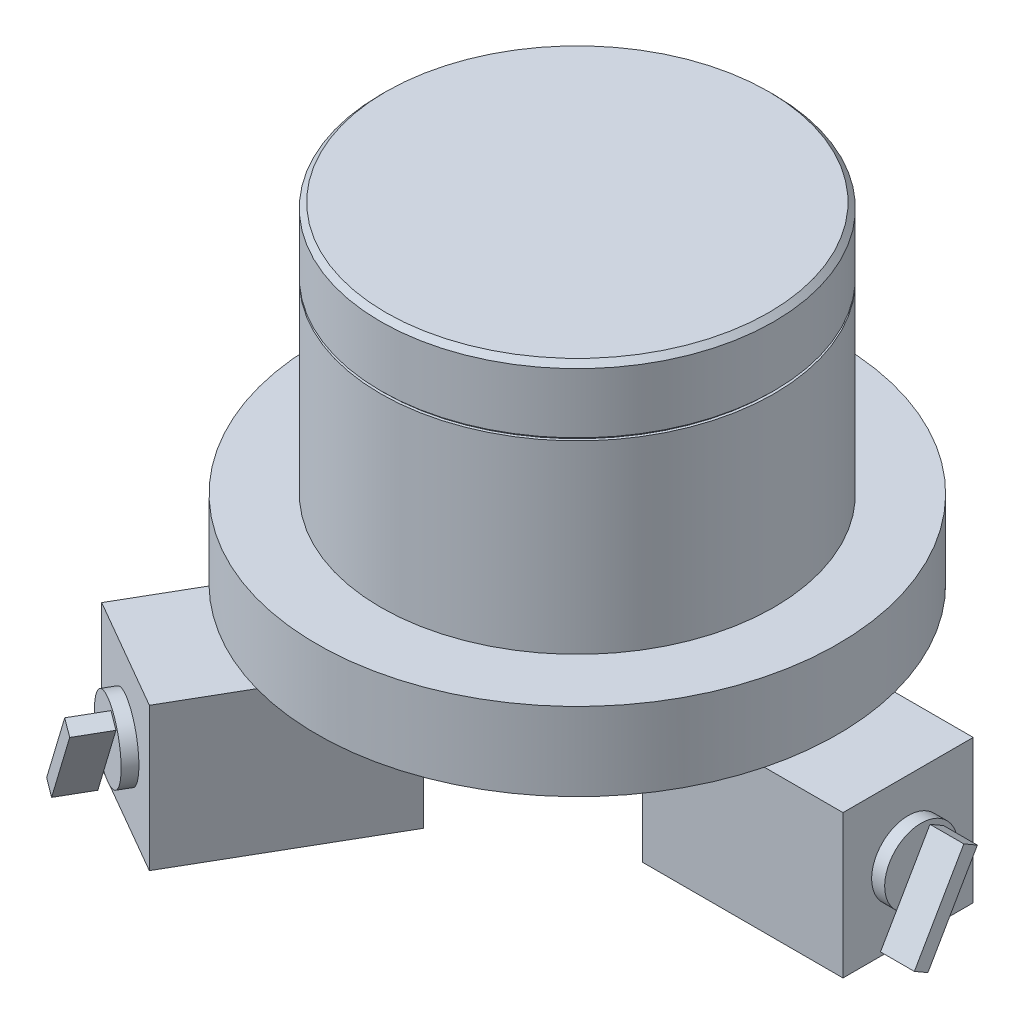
ISO-10303-21;
HEADER;
FILE_DESCRIPTION(('STEP AP214'),'2;1');
FILE_NAME('part.step','',(''),(''),'','','');
FILE_SCHEMA(('AUTOMOTIVE_DESIGN { 1 0 10303 214 1 1 1 1 }'));
ENDSEC;
DATA;
#1=APPLICATION_CONTEXT('core data for automotive mechanical design processes');
#2=APPLICATION_PROTOCOL_DEFINITION('international standard','automotive_design',2000,#1);
#3=PRODUCT_CONTEXT('',#1,'mechanical');
#4=PRODUCT('Part','Part','',(#3));
#5=PRODUCT_RELATED_PRODUCT_CATEGORY('part','',(#4));
#6=PRODUCT_DEFINITION_FORMATION('','',#4);
#7=PRODUCT_DEFINITION_CONTEXT('part definition',#1,'design');
#8=PRODUCT_DEFINITION('design','',#6,#7);
#9=PRODUCT_DEFINITION_SHAPE('','',#8);
#10=(LENGTH_UNIT() NAMED_UNIT(*) SI_UNIT(.MILLI.,.METRE.));
#11=(NAMED_UNIT(*) PLANE_ANGLE_UNIT() SI_UNIT($,.RADIAN.));
#12=(NAMED_UNIT(*) SI_UNIT($,.STERADIAN.) SOLID_ANGLE_UNIT());
#13=UNCERTAINTY_MEASURE_WITH_UNIT(LENGTH_MEASURE(1.E-05),#10,'distance_accuracy_value','');
#14=(GEOMETRIC_REPRESENTATION_CONTEXT(3) GLOBAL_UNCERTAINTY_ASSIGNED_CONTEXT((#13)) GLOBAL_UNIT_ASSIGNED_CONTEXT((#10,
#11,#12)) REPRESENTATION_CONTEXT('',''));
#15=CARTESIAN_POINT('',(0.,0.,0.));
#16=DIRECTION('',(0.,0.,1.));
#17=DIRECTION('',(1.,0.,0.));
#18=AXIS2_PLACEMENT_3D('',#15,#16,#17);
#19=CARTESIAN_POINT('',(-85.1506350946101,0.,97.4852262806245));
#20=DIRECTION('',(-0.499999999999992,0.,0.866025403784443));
#21=DIRECTION('',(0.866025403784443,0.,0.499999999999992));
#22=AXIS2_PLACEMENT_3D('',#19,#20,#21);
#23=PLANE('',#22);
#24=DIRECTION('',(0.866025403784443,0.,0.499999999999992));
#25=VECTOR('',#24,1.);
#26=CARTESIAN_POINT('',(-85.1506350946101,55.,97.4852262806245));
#27=LINE('',#26,#25);
#28=CARTESIAN_POINT('',(-85.1506350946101,55.,97.4852262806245));
#29=VERTEX_POINT('',#28);
#30=CARTESIAN_POINT('',(-41.8493649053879,55.,122.485226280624));
#31=VERTEX_POINT('',#30);
#32=EDGE_CURVE('E302',#29,#31,#27,.T.);
#33=ORIENTED_EDGE('',*,*,#32,.F.);
#34=DIRECTION('',(0.,1.,0.));
#35=VECTOR('',#34,1.);
#36=CARTESIAN_POINT('',(-85.1506350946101,0.,97.4852262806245));
#37=LINE('',#36,#35);
#38=CARTESIAN_POINT('',(-85.1506350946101,0.,97.4852262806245));
#39=VERTEX_POINT('',#38);
#40=EDGE_CURVE('E328',#39,#29,#37,.T.);
#41=ORIENTED_EDGE('',*,*,#40,.F.);
#42=DIRECTION('',(0.866025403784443,0.,0.499999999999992));
#43=VECTOR('',#42,1.);
#44=CARTESIAN_POINT('',(-85.1506350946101,0.,97.4852262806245));
#45=LINE('',#44,#43);
#46=CARTESIAN_POINT('',(-41.8493649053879,0.,122.485226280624));
#47=VERTEX_POINT('',#46);
#48=EDGE_CURVE('E315',#39,#47,#45,.T.);
#49=ORIENTED_EDGE('',*,*,#48,.T.);
#50=DIRECTION('',(0.,1.,0.));
#51=VECTOR('',#50,1.);
#52=CARTESIAN_POINT('',(-41.8493649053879,0.,122.485226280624));
#53=LINE('',#52,#51);
#54=EDGE_CURVE('E327',#47,#31,#53,.T.);
#55=ORIENTED_EDGE('',*,*,#54,.T.);
#56=EDGE_LOOP('',(#33,#41,#49,#55));
#57=FACE_BOUND('',#56,.T.);
#58=CARTESIAN_POINT('',(-63.499999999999,27.5,109.985226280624));
#59=DIRECTION('',(-0.499999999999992,0.,0.866025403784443));
#60=DIRECTION('',(0.866025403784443,0.,0.499999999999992));
#61=AXIS2_PLACEMENT_3D('',#58,#59,#60);
#62=CIRCLE('',#61,14.);
#63=CARTESIAN_POINT('',(-51.3756443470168,27.5,116.985226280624));
#64=VERTEX_POINT('',#63);
#65=EDGE_CURVE('E289',#64,#64,#62,.T.);
#66=ORIENTED_EDGE('',*,*,#65,.F.);
#67=EDGE_LOOP('',(#66));
#68=FACE_BOUND('',#67,.T.);
#69=ADVANCED_FACE('F32',(#57,#68),#23,.T.);
#70=CARTESIAN_POINT('',(-41.8493649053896,0.,-122.485226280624));
#71=DIRECTION('',(-0.500000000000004,0.,-0.866025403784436));
#72=DIRECTION('',(-0.866025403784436,0.,0.500000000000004));
#73=AXIS2_PLACEMENT_3D('',#70,#71,#72);
#74=PLANE('',#73);
#75=DIRECTION('',(-0.866025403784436,0.,0.500000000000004));
#76=VECTOR('',#75,1.);
#77=CARTESIAN_POINT('',(-41.8493649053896,55.,-122.485226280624));
#78=LINE('',#77,#76);
#79=CARTESIAN_POINT('',(-41.8493649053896,55.,-122.485226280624));
#80=VERTEX_POINT('',#79);
#81=CARTESIAN_POINT('',(-85.1506350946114,55.,-97.4852262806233));
#82=VERTEX_POINT('',#81);
#83=EDGE_CURVE('E331',#80,#82,#78,.T.);
#84=ORIENTED_EDGE('',*,*,#83,.F.);
#85=DIRECTION('',(0.,1.,0.));
#86=VECTOR('',#85,1.);
#87=CARTESIAN_POINT('',(-41.8493649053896,0.,-122.485226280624));
#88=LINE('',#87,#86);
#89=CARTESIAN_POINT('',(-41.8493649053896,0.,-122.485226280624));
#90=VERTEX_POINT('',#89);
#91=EDGE_CURVE('E364',#90,#80,#88,.T.);
#92=ORIENTED_EDGE('',*,*,#91,.F.);
#93=DIRECTION('',(-0.866025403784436,0.,0.500000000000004));
#94=VECTOR('',#93,1.);
#95=CARTESIAN_POINT('',(-41.8493649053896,0.,-122.485226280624));
#96=LINE('',#95,#94);
#97=CARTESIAN_POINT('',(-85.1506350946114,0.,-97.4852262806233));
#98=VERTEX_POINT('',#97);
#99=EDGE_CURVE('E351',#90,#98,#96,.T.);
#100=ORIENTED_EDGE('',*,*,#99,.T.);
#101=DIRECTION('',(0.,1.,0.));
#102=VECTOR('',#101,1.);
#103=CARTESIAN_POINT('',(-85.1506350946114,0.,-97.4852262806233));
#104=LINE('',#103,#102);
#105=EDGE_CURVE('E363',#98,#82,#104,.T.);
#106=ORIENTED_EDGE('',*,*,#105,.T.);
#107=EDGE_LOOP('',(#84,#92,#100,#106));
#108=FACE_BOUND('',#107,.T.);
#109=CARTESIAN_POINT('',(-63.5000000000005,27.5,-109.985226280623));
#110=DIRECTION('',(-0.500000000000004,0.,-0.866025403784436));
#111=DIRECTION('',(-0.866025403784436,0.,0.500000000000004));
#112=AXIS2_PLACEMENT_3D('',#109,#110,#111);
#113=CIRCLE('',#112,14.);
#114=CARTESIAN_POINT('',(-75.6243556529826,27.5,-102.985226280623));
#115=VERTEX_POINT('',#114);
#116=EDGE_CURVE('E295',#115,#115,#113,.T.);
#117=ORIENTED_EDGE('',*,*,#116,.F.);
#118=EDGE_LOOP('',(#117));
#119=FACE_BOUND('',#118,.T.);
#120=ADVANCED_FACE('F533',(#108,#119),#74,.T.);
#121=CARTESIAN_POINT('',(127.,0.,25.));
#122=DIRECTION('',(1.,0.,0.));
#123=DIRECTION('',(0.,0.,-1.));
#124=AXIS2_PLACEMENT_3D('',#121,#122,#123);
#125=PLANE('',#124);
#126=DIRECTION('',(0.,0.,-1.));
#127=VECTOR('',#126,1.);
#128=CARTESIAN_POINT('',(127.,55.,25.));
#129=LINE('',#128,#127);
#130=CARTESIAN_POINT('',(127.,55.,25.));
#131=VERTEX_POINT('',#130);
#132=CARTESIAN_POINT('',(127.,55.,-25.));
#133=VERTEX_POINT('',#132);
#134=EDGE_CURVE('E415',#131,#133,#129,.T.);
#135=ORIENTED_EDGE('',*,*,#134,.F.);
#136=DIRECTION('',(0.,1.,0.));
#137=VECTOR('',#136,1.);
#138=CARTESIAN_POINT('',(127.,0.,25.));
#139=LINE('',#138,#137);
#140=CARTESIAN_POINT('',(127.,0.,25.));
#141=VERTEX_POINT('',#140);
#142=EDGE_CURVE('E442',#141,#131,#139,.T.);
#143=ORIENTED_EDGE('',*,*,#142,.F.);
#144=DIRECTION('',(0.,0.,-1.));
#145=VECTOR('',#144,1.);
#146=CARTESIAN_POINT('',(127.,0.,25.));
#147=LINE('',#146,#145);
#148=CARTESIAN_POINT('',(127.,0.,-25.));
#149=VERTEX_POINT('',#148);
#150=EDGE_CURVE('E429',#141,#149,#147,.T.);
#151=ORIENTED_EDGE('',*,*,#150,.T.);
#152=DIRECTION('',(0.,1.,0.));
#153=VECTOR('',#152,1.);
#154=CARTESIAN_POINT('',(127.,0.,-25.));
#155=LINE('',#154,#153);
#156=EDGE_CURVE('E441',#149,#133,#155,.T.);
#157=ORIENTED_EDGE('',*,*,#156,.T.);
#158=EDGE_LOOP('',(#135,#143,#151,#157));
#159=FACE_BOUND('',#158,.T.);
#160=CARTESIAN_POINT('',(127.,27.5,0.));
#161=DIRECTION('',(1.,0.,0.));
#162=DIRECTION('',(0.,0.,-1.));
#163=AXIS2_PLACEMENT_3D('',#160,#161,#162);
#164=CIRCLE('',#163,14.);
#165=CARTESIAN_POINT('',(127.,27.5,-14.));
#166=VERTEX_POINT('',#165);
#167=EDGE_CURVE('E408',#166,#166,#164,.T.);
#168=ORIENTED_EDGE('',*,*,#167,.F.);
#169=EDGE_LOOP('',(#168));
#170=FACE_BOUND('',#169,.T.);
#171=ADVANCED_FACE('F539',(#159,#170),#125,.T.);
#172=CARTESIAN_POINT('',(0.,55.,0.));
#173=DIRECTION('',(0.,-1.,0.));
#174=DIRECTION('',(0.,0.,-1.));
#175=AXIS2_PLACEMENT_3D('',#172,#173,#174);
#176=PLANE('',#175);
#177=DIRECTION('',(-0.499999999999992,0.,0.866025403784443));
#178=VECTOR('',#177,1.);
#179=CARTESIAN_POINT('',(-85.1506350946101,55.,97.4852262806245));
#180=LINE('',#179,#178);
#181=CARTESIAN_POINT('',(-46.6506350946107,55.,30.8012701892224));
#182=VERTEX_POINT('',#181);
#183=CARTESIAN_POINT('',(-70.062926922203,55.,71.3525491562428));
#184=VERTEX_POINT('',#183);
#185=EDGE_CURVE('E312',#182,#184,#180,.T.);
#186=ORIENTED_EDGE('',*,*,#185,.T.);
#187=CARTESIAN_POINT('',(0.,55.,0.));
#188=DIRECTION('',(0.,-1.,0.));
#189=DIRECTION('',(0.,0.,-1.));
#190=AXIS2_PLACEMENT_3D('',#187,#188,#189);
#191=CIRCLE('',#190,100.);
#192=CARTESIAN_POINT('',(-70.062926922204,55.,-71.3525491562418));
#193=VERTEX_POINT('',#192);
#194=EDGE_CURVE('E481',#184,#193,#191,.T.);
#195=ORIENTED_EDGE('',*,*,#194,.T.);
#196=DIRECTION('',(0.500000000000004,0.,0.866025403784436));
#197=VECTOR('',#196,1.);
#198=CARTESIAN_POINT('',(-85.1506350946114,55.,-97.4852262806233));
#199=LINE('',#198,#197);
#200=CARTESIAN_POINT('',(-46.6506350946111,55.,-30.8012701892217));
#201=VERTEX_POINT('',#200);
#202=EDGE_CURVE('E341',#193,#201,#199,.T.);
#203=ORIENTED_EDGE('',*,*,#202,.T.);
#204=DIRECTION('',(0.866025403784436,0.,-0.500000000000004));
#205=VECTOR('',#204,1.);
#206=CARTESIAN_POINT('',(-3.34936490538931,55.,-55.8012701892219));
#207=LINE('',#206,#205);
#208=CARTESIAN_POINT('',(-3.34936490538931,55.,-55.8012701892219));
#209=VERTEX_POINT('',#208);
#210=EDGE_CURVE('E345',#201,#209,#207,.T.);
#211=ORIENTED_EDGE('',*,*,#210,.T.);
#212=DIRECTION('',(-0.500000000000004,0.,-0.866025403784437));
#213=VECTOR('',#212,1.);
#214=CARTESIAN_POINT('',(-41.8493649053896,55.,-122.485226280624));
#215=LINE('',#214,#213);
#216=CARTESIAN_POINT('',(-26.7616567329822,55.,-96.352549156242));
#217=VERTEX_POINT('',#216);
#218=EDGE_CURVE('E348',#209,#217,#215,.T.);
#219=ORIENTED_EDGE('',*,*,#218,.T.);
#220=CARTESIAN_POINT('',(96.8245836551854,55.,-25.));
#221=VERTEX_POINT('',#220);
#222=EDGE_CURVE('E472',#217,#221,#191,.T.);
#223=ORIENTED_EDGE('',*,*,#222,.T.);
#224=DIRECTION('',(-1.,0.,0.));
#225=VECTOR('',#224,1.);
#226=CARTESIAN_POINT('',(127.,55.,-25.));
#227=LINE('',#226,#225);
#228=CARTESIAN_POINT('',(50.,55.,-25.));
#229=VERTEX_POINT('',#228);
#230=EDGE_CURVE('E422',#221,#229,#227,.T.);
#231=ORIENTED_EDGE('',*,*,#230,.T.);
#232=DIRECTION('',(0.,0.,1.));
#233=VECTOR('',#232,1.);
#234=CARTESIAN_POINT('',(50.,55.,25.));
#235=LINE('',#234,#233);
#236=CARTESIAN_POINT('',(50.,55.,25.));
#237=VERTEX_POINT('',#236);
#238=EDGE_CURVE('E421',#229,#237,#235,.T.);
#239=ORIENTED_EDGE('',*,*,#238,.T.);
#240=DIRECTION('',(1.,0.,0.));
#241=VECTOR('',#240,1.);
#242=CARTESIAN_POINT('',(127.,55.,25.));
#243=LINE('',#242,#241);
#244=CARTESIAN_POINT('',(96.8245836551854,55.,25.));
#245=VERTEX_POINT('',#244);
#246=EDGE_CURVE('E426',#237,#245,#243,.T.);
#247=ORIENTED_EDGE('',*,*,#246,.T.);
#248=CARTESIAN_POINT('',(-26.7616567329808,55.,96.3525491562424));
#249=VERTEX_POINT('',#248);
#250=EDGE_CURVE('E482',#245,#249,#191,.T.);
#251=ORIENTED_EDGE('',*,*,#250,.T.);
#252=DIRECTION('',(0.499999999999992,0.,-0.866025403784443));
#253=VECTOR('',#252,1.);
#254=CARTESIAN_POINT('',(-41.8493649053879,55.,122.485226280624));
#255=LINE('',#254,#253);
#256=CARTESIAN_POINT('',(-3.34936490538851,55.,55.801270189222));
#257=VERTEX_POINT('',#256);
#258=EDGE_CURVE('E305',#249,#257,#255,.T.);
#259=ORIENTED_EDGE('',*,*,#258,.T.);
#260=DIRECTION('',(-0.866025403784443,0.,-0.499999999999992));
#261=VECTOR('',#260,1.);
#262=CARTESIAN_POINT('',(-46.6506350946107,55.,30.8012701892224));
#263=LINE('',#262,#261);
#264=EDGE_CURVE('E309',#257,#182,#263,.T.);
#265=ORIENTED_EDGE('',*,*,#264,.T.);
#266=EDGE_LOOP('',(#186,#195,#203,#211,#219,#223,#231,#239,#247,#251,#259,#265));
#267=FACE_BOUND('',#266,.T.);
#268=ADVANCED_FACE('F34',(#267),#176,.T.);
#269=CARTESIAN_POINT('',(0.,-14.7594594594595,0.));
#270=DIRECTION('',(0.,-1.,0.));
#271=DIRECTION('',(0.,0.,-1.));
#272=AXIS2_PLACEMENT_3D('',#269,#270,#271);
#273=CYLINDRICAL_SURFACE('',#272,100.);
#274=CARTESIAN_POINT('',(0.,85.,0.));
#275=DIRECTION('',(0.,-1.,0.));
#276=DIRECTION('',(0.,0.,-1.));
#277=AXIS2_PLACEMENT_3D('',#274,#275,#276);
#278=CIRCLE('',#277,100.);
#279=CARTESIAN_POINT('',(0.,85.,-100.));
#280=VERTEX_POINT('',#279);
#281=EDGE_CURVE('E470',#280,#280,#278,.T.);
#282=ORIENTED_EDGE('',*,*,#281,.T.);
#283=EDGE_LOOP('',(#282));
#284=FACE_BOUND('',#283,.T.);
#285=EDGE_CURVE('E36',#221,#245,#191,.T.);
#286=ORIENTED_EDGE('',*,*,#285,.F.);
#287=ORIENTED_EDGE('',*,*,#222,.F.);
#288=EDGE_CURVE('E475',#193,#217,#191,.T.);
#289=ORIENTED_EDGE('',*,*,#288,.F.);
#290=ORIENTED_EDGE('',*,*,#194,.F.);
#291=EDGE_CURVE('E476',#249,#184,#191,.T.);
#292=ORIENTED_EDGE('',*,*,#291,.F.);
#293=ORIENTED_EDGE('',*,*,#250,.F.);
#294=EDGE_LOOP('',(#286,#287,#289,#290,#292,#293));
#295=FACE_BOUND('',#294,.T.);
#296=ADVANCED_FACE('F652',(#284,#295),#273,.T.);
#297=CARTESIAN_POINT('',(100.,85.,0.));
#298=DIRECTION('',(0.,1.,0.));
#299=DIRECTION('',(0.,0.,1.));
#300=AXIS2_PLACEMENT_3D('',#297,#298,#299);
#301=PLANE('',#300);
#302=CARTESIAN_POINT('',(0.,85.,0.));
#303=DIRECTION('',(0.,-1.,0.));
#304=DIRECTION('',(0.,0.,-1.));
#305=AXIS2_PLACEMENT_3D('',#302,#303,#304);
#306=CIRCLE('',#305,75.5);
#307=CARTESIAN_POINT('',(0.,85.,-75.5));
#308=VERTEX_POINT('',#307);
#309=EDGE_CURVE('E468',#308,#308,#306,.T.);
#310=ORIENTED_EDGE('',*,*,#309,.T.);
#311=EDGE_LOOP('',(#310));
#312=FACE_BOUND('',#311,.T.);
#313=ORIENTED_EDGE('',*,*,#281,.F.);
#314=EDGE_LOOP('',(#313));
#315=FACE_BOUND('',#314,.T.);
#316=ADVANCED_FACE('F649',(#312,#315),#301,.T.);
#317=CARTESIAN_POINT('',(0.,-14.7594594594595,0.));
#318=DIRECTION('',(0.,-1.,0.));
#319=DIRECTION('',(0.,0.,-1.));
#320=AXIS2_PLACEMENT_3D('',#317,#318,#319);
#321=CYLINDRICAL_SURFACE('',#320,75.5);
#322=CARTESIAN_POINT('',(0.,156.,0.));
#323=DIRECTION('',(0.,-1.,0.));
#324=DIRECTION('',(0.,0.,-1.));
#325=AXIS2_PLACEMENT_3D('',#322,#323,#324);
#326=CIRCLE('',#325,75.5);
#327=CARTESIAN_POINT('',(0.,156.,-75.5));
#328=VERTEX_POINT('',#327);
#329=EDGE_CURVE('E465',#328,#328,#326,.T.);
#330=ORIENTED_EDGE('',*,*,#329,.T.);
#331=EDGE_LOOP('',(#330));
#332=FACE_BOUND('',#331,.T.);
#333=ORIENTED_EDGE('',*,*,#309,.F.);
#334=EDGE_LOOP('',(#333));
#335=FACE_BOUND('',#334,.T.);
#336=ADVANCED_FACE('F645',(#332,#335),#321,.T.);
#337=CARTESIAN_POINT('',(75.5,156.,0.));
#338=DIRECTION('',(0.,1.,0.));
#339=DIRECTION('',(0.,0.,1.));
#340=AXIS2_PLACEMENT_3D('',#337,#338,#339);
#341=PLANE('',#340);
#342=CARTESIAN_POINT('',(0.,156.,0.));
#343=DIRECTION('',(0.,-1.,0.));
#344=DIRECTION('',(0.,0.,-1.));
#345=AXIS2_PLACEMENT_3D('',#342,#343,#344);
#346=CIRCLE('',#345,74.5);
#347=CARTESIAN_POINT('',(0.,156.,-74.5));
#348=VERTEX_POINT('',#347);
#349=EDGE_CURVE('E462',#348,#348,#346,.T.);
#350=ORIENTED_EDGE('',*,*,#349,.T.);
#351=EDGE_LOOP('',(#350));
#352=FACE_BOUND('',#351,.T.);
#353=ORIENTED_EDGE('',*,*,#329,.F.);
#354=EDGE_LOOP('',(#353));
#355=FACE_BOUND('',#354,.T.);
#356=ADVANCED_FACE('F641',(#352,#355),#341,.T.);
#357=CARTESIAN_POINT('',(0.,-14.7594594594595,0.));
#358=DIRECTION('',(0.,-1.,0.));
#359=DIRECTION('',(0.,0.,-1.));
#360=AXIS2_PLACEMENT_3D('',#357,#358,#359);
#361=CYLINDRICAL_SURFACE('',#360,74.5);
#362=CARTESIAN_POINT('',(0.,157.,0.));
#363=DIRECTION('',(0.,-1.,0.));
#364=DIRECTION('',(0.,0.,-1.));
#365=AXIS2_PLACEMENT_3D('',#362,#363,#364);
#366=CIRCLE('',#365,74.5);
#367=CARTESIAN_POINT('',(0.,157.,-74.5));
#368=VERTEX_POINT('',#367);
#369=EDGE_CURVE('E459',#368,#368,#366,.T.);
#370=ORIENTED_EDGE('',*,*,#369,.T.);
#371=EDGE_LOOP('',(#370));
#372=FACE_BOUND('',#371,.T.);
#373=ORIENTED_EDGE('',*,*,#349,.F.);
#374=EDGE_LOOP('',(#373));
#375=FACE_BOUND('',#374,.T.);
#376=ADVANCED_FACE('F637',(#372,#375),#361,.T.);
#377=CARTESIAN_POINT('',(74.5,157.,0.));
#378=DIRECTION('',(0.,-1.,0.));
#379=DIRECTION('',(0.,0.,-1.));
#380=AXIS2_PLACEMENT_3D('',#377,#378,#379);
#381=PLANE('',#380);
#382=CARTESIAN_POINT('',(0.,157.,0.));
#383=DIRECTION('',(0.,-1.,0.));
#384=DIRECTION('',(0.,0.,-1.));
#385=AXIS2_PLACEMENT_3D('',#382,#383,#384);
#386=CIRCLE('',#385,75.5);
#387=CARTESIAN_POINT('',(0.,157.,-75.5));
#388=VERTEX_POINT('',#387);
#389=EDGE_CURVE('E456',#388,#388,#386,.T.);
#390=ORIENTED_EDGE('',*,*,#389,.T.);
#391=EDGE_LOOP('',(#390));
#392=FACE_BOUND('',#391,.T.);
#393=ORIENTED_EDGE('',*,*,#369,.F.);
#394=EDGE_LOOP('',(#393));
#395=FACE_BOUND('',#394,.T.);
#396=ADVANCED_FACE('F633',(#392,#395),#381,.T.);
#397=CARTESIAN_POINT('',(0.,-14.7594594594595,0.));
#398=DIRECTION('',(0.,-1.,0.));
#399=DIRECTION('',(0.,0.,-1.));
#400=AXIS2_PLACEMENT_3D('',#397,#398,#399);
#401=CYLINDRICAL_SURFACE('',#400,75.5);
#402=CARTESIAN_POINT('',(0.,180.,0.));
#403=DIRECTION('',(0.,-1.,0.));
#404=DIRECTION('',(0.,0.,-1.));
#405=AXIS2_PLACEMENT_3D('',#402,#403,#404);
#406=CIRCLE('',#405,75.5);
#407=CARTESIAN_POINT('',(0.,180.,-75.5));
#408=VERTEX_POINT('',#407);
#409=EDGE_CURVE('E453',#408,#408,#406,.T.);
#410=ORIENTED_EDGE('',*,*,#409,.T.);
#411=EDGE_LOOP('',(#410));
#412=FACE_BOUND('',#411,.T.);
#413=ORIENTED_EDGE('',*,*,#389,.F.);
#414=EDGE_LOOP('',(#413));
#415=FACE_BOUND('',#414,.T.);
#416=ADVANCED_FACE('F629',(#412,#415),#401,.T.);
#417=CARTESIAN_POINT('',(0.,180.,0.));
#418=DIRECTION('',(0.,-1.,0.));
#419=DIRECTION('',(0.,0.,-1.));
#420=AXIS2_PLACEMENT_3D('',#417,#418,#419);
#421=CONICAL_SURFACE('',#420,75.5,0.785398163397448);
#422=CARTESIAN_POINT('',(0.,182.,0.));
#423=DIRECTION('',(0.,-1.,0.));
#424=DIRECTION('',(0.,0.,-1.));
#425=AXIS2_PLACEMENT_3D('',#422,#423,#424);
#426=CIRCLE('',#425,73.5);
#427=CARTESIAN_POINT('',(0.,182.,-73.5));
#428=VERTEX_POINT('',#427);
#429=EDGE_CURVE('E445',#428,#428,#426,.T.);
#430=ORIENTED_EDGE('',*,*,#429,.T.);
#431=EDGE_LOOP('',(#430));
#432=FACE_BOUND('',#431,.T.);
#433=ORIENTED_EDGE('',*,*,#409,.F.);
#434=EDGE_LOOP('',(#433));
#435=FACE_BOUND('',#434,.T.);
#436=ADVANCED_FACE('F625',(#432,#435),#421,.T.);
#437=CARTESIAN_POINT('',(73.5,182.,0.));
#438=DIRECTION('',(0.,1.,0.));
#439=DIRECTION('',(0.,0.,1.));
#440=AXIS2_PLACEMENT_3D('',#437,#438,#439);
#441=PLANE('',#440);
#442=ORIENTED_EDGE('',*,*,#429,.F.);
#443=EDGE_LOOP('',(#442));
#444=FACE_BOUND('',#443,.T.);
#445=ADVANCED_FACE('F612',(#444),#441,.T.);
#446=CARTESIAN_POINT('',(127.,0.,25.));
#447=DIRECTION('',(0.,0.,1.));
#448=DIRECTION('',(1.,0.,0.));
#449=AXIS2_PLACEMENT_3D('',#446,#447,#448);
#450=PLANE('',#449);
#451=ORIENTED_EDGE('',*,*,#246,.F.);
#452=DIRECTION('',(0.,1.,0.));
#453=VECTOR('',#452,1.);
#454=CARTESIAN_POINT('',(50.,0.,25.));
#455=LINE('',#454,#453);
#456=CARTESIAN_POINT('',(50.,0.,25.));
#457=VERTEX_POINT('',#456);
#458=EDGE_CURVE('E446',#457,#237,#455,.T.);
#459=ORIENTED_EDGE('',*,*,#458,.F.);
#460=DIRECTION('',(1.,0.,0.));
#461=VECTOR('',#460,1.);
#462=CARTESIAN_POINT('',(127.,0.,25.));
#463=LINE('',#462,#461);
#464=EDGE_CURVE('E438',#457,#141,#463,.T.);
#465=ORIENTED_EDGE('',*,*,#464,.T.);
#466=ORIENTED_EDGE('',*,*,#142,.T.);
#467=EDGE_CURVE('E425',#245,#131,#243,.T.);
#468=ORIENTED_EDGE('',*,*,#467,.F.);
#469=EDGE_LOOP('',(#451,#459,#465,#466,#468));
#470=FACE_BOUND('',#469,.T.);
#471=ADVANCED_FACE('F608',(#470),#450,.T.);
#472=CARTESIAN_POINT('',(50.,0.,25.));
#473=DIRECTION('',(-1.,0.,0.));
#474=DIRECTION('',(0.,0.,1.));
#475=AXIS2_PLACEMENT_3D('',#472,#473,#474);
#476=PLANE('',#475);
#477=ORIENTED_EDGE('',*,*,#238,.F.);
#478=DIRECTION('',(0.,1.,0.));
#479=VECTOR('',#478,1.);
#480=CARTESIAN_POINT('',(50.,0.,-25.));
#481=LINE('',#480,#479);
#482=CARTESIAN_POINT('',(50.,0.,-25.));
#483=VERTEX_POINT('',#482);
#484=EDGE_CURVE('E448',#483,#229,#481,.T.);
#485=ORIENTED_EDGE('',*,*,#484,.F.);
#486=DIRECTION('',(0.,0.,1.));
#487=VECTOR('',#486,1.);
#488=CARTESIAN_POINT('',(50.,0.,25.));
#489=LINE('',#488,#487);
#490=EDGE_CURVE('E435',#483,#457,#489,.T.);
#491=ORIENTED_EDGE('',*,*,#490,.T.);
#492=ORIENTED_EDGE('',*,*,#458,.T.);
#493=EDGE_LOOP('',(#477,#485,#491,#492));
#494=FACE_BOUND('',#493,.T.);
#495=ADVANCED_FACE('F611',(#494),#476,.T.);
#496=CARTESIAN_POINT('',(127.,0.,-25.));
#497=DIRECTION('',(0.,0.,-1.));
#498=DIRECTION('',(-1.,0.,0.));
#499=AXIS2_PLACEMENT_3D('',#496,#497,#498);
#500=PLANE('',#499);
#501=EDGE_CURVE('E418',#133,#221,#227,.T.);
#502=ORIENTED_EDGE('',*,*,#501,.F.);
#503=ORIENTED_EDGE('',*,*,#156,.F.);
#504=DIRECTION('',(-1.,0.,0.));
#505=VECTOR('',#504,1.);
#506=CARTESIAN_POINT('',(127.,0.,-25.));
#507=LINE('',#506,#505);
#508=EDGE_CURVE('E432',#149,#483,#507,.T.);
#509=ORIENTED_EDGE('',*,*,#508,.T.);
#510=ORIENTED_EDGE('',*,*,#484,.T.);
#511=ORIENTED_EDGE('',*,*,#230,.F.);
#512=EDGE_LOOP('',(#502,#503,#509,#510,#511));
#513=FACE_BOUND('',#512,.T.);
#514=ADVANCED_FACE('F606',(#513),#500,.T.);
#515=CARTESIAN_POINT('',(127.,0.,-25.));
#516=DIRECTION('',(0.,1.,0.));
#517=DIRECTION('',(0.,0.,1.));
#518=AXIS2_PLACEMENT_3D('',#515,#516,#517);
#519=PLANE('',#518);
#520=ORIENTED_EDGE('',*,*,#150,.F.);
#521=ORIENTED_EDGE('',*,*,#464,.F.);
#522=ORIENTED_EDGE('',*,*,#490,.F.);
#523=ORIENTED_EDGE('',*,*,#508,.F.);
#524=EDGE_LOOP('',(#520,#521,#522,#523));
#525=FACE_BOUND('',#524,.T.);
#526=ADVANCED_FACE('F603',(#525),#519,.F.);
#527=CARTESIAN_POINT('',(127.,55.,-25.));
#528=DIRECTION('',(0.,1.,0.));
#529=DIRECTION('',(0.,0.,1.));
#530=AXIS2_PLACEMENT_3D('',#527,#528,#529);
#531=PLANE('',#530);
#532=ORIENTED_EDGE('',*,*,#501,.T.);
#533=ORIENTED_EDGE('',*,*,#285,.T.);
#534=ORIENTED_EDGE('',*,*,#467,.T.);
#535=ORIENTED_EDGE('',*,*,#134,.T.);
#536=EDGE_LOOP('',(#532,#533,#534,#535));
#537=FACE_BOUND('',#536,.T.);
#538=ADVANCED_FACE('F599',(#537),#531,.T.);
#539=CARTESIAN_POINT('',(132.,27.5,0.));
#540=DIRECTION('',(-1.,0.,0.));
#541=DIRECTION('',(0.,0.,1.));
#542=AXIS2_PLACEMENT_3D('',#539,#540,#541);
#543=CYLINDRICAL_SURFACE('',#542,14.);
#544=CARTESIAN_POINT('',(132.,27.5,0.));
#545=DIRECTION('',(1.,0.,0.));
#546=DIRECTION('',(0.,0.,-1.));
#547=AXIS2_PLACEMENT_3D('',#544,#545,#546);
#548=CIRCLE('',#547,14.);
#549=CARTESIAN_POINT('',(132.,17.1572807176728,9.43547337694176));
#550=VERTEX_POINT('',#549);
#551=CARTESIAN_POINT('',(132.,14.1572807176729,4.23932095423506));
#552=VERTEX_POINT('',#551);
#553=EDGE_CURVE('E412',#550,#552,#548,.T.);
#554=ORIENTED_EDGE('',*,*,#553,.F.);
#555=EDGE_CURVE('E411',#552,#550,#548,.T.);
#556=ORIENTED_EDGE('',*,*,#555,.F.);
#557=EDGE_LOOP('',(#554,#556));
#558=FACE_BOUND('',#557,.T.);
#559=ORIENTED_EDGE('',*,*,#167,.T.);
#560=EDGE_LOOP('',(#559));
#561=FACE_BOUND('',#560,.T.);
#562=ADVANCED_FACE('F595',(#558,#561),#543,.T.);
#563=CARTESIAN_POINT('',(132.,27.5,0.));
#564=DIRECTION('',(1.,0.,0.));
#565=DIRECTION('',(0.,0.,-1.));
#566=AXIS2_PLACEMENT_3D('',#563,#564,#565);
#567=PLANE('',#566);
#568=DIRECTION('',(0.,-0.866025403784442,0.499999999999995));
#569=VECTOR('',#568,1.);
#570=CARTESIAN_POINT('',(132.,39.3923048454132,-3.40192378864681));
#571=LINE('',#570,#569);
#572=CARTESIAN_POINT('',(132.,39.3923048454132,-3.40192378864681));
#573=VERTEX_POINT('',#572);
#574=EDGE_CURVE('E375',#573,#550,#571,.T.);
#575=ORIENTED_EDGE('',*,*,#574,.F.);
#576=DIRECTION('',(0.,0.499999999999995,0.866025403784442));
#577=VECTOR('',#576,1.);
#578=CARTESIAN_POINT('',(132.,39.3923048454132,-3.40192378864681));
#579=LINE('',#578,#577);
#580=CARTESIAN_POINT('',(132.,36.3923048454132,-8.59807621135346));
#581=VERTEX_POINT('',#580);
#582=EDGE_CURVE('E383',#581,#573,#579,.T.);
#583=ORIENTED_EDGE('',*,*,#582,.F.);
#584=DIRECTION('',(0.,0.866025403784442,-0.499999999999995));
#585=VECTOR('',#584,1.);
#586=CARTESIAN_POINT('',(132.,36.3923048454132,-8.59807621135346));
#587=LINE('',#586,#585);
#588=EDGE_CURVE('E384',#552,#581,#587,.T.);
#589=ORIENTED_EDGE('',*,*,#588,.F.);
#590=ORIENTED_EDGE('',*,*,#555,.T.);
#591=EDGE_LOOP('',(#575,#583,#589,#590));
#592=FACE_BOUND('',#591,.T.);
#593=ADVANCED_FACE('F574',(#592),#567,.T.);
#594=CARTESIAN_POINT('',(132.,39.3923048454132,-3.40192378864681));
#595=DIRECTION('',(1.,0.,0.));
#596=DIRECTION('',(0.,0.,-1.));
#597=AXIS2_PLACEMENT_3D('',#594,#595,#596);
#598=PLANE('',#597);
#599=CARTESIAN_POINT('',(132.,6.4833395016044,15.598076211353));
#600=VERTEX_POINT('',#599);
#601=EDGE_CURVE('E367',#550,#600,#571,.T.);
#602=ORIENTED_EDGE('',*,*,#601,.F.);
#603=ORIENTED_EDGE('',*,*,#553,.T.);
#604=CARTESIAN_POINT('',(132.,3.48333950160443,10.4019237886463));
#605=VERTEX_POINT('',#604);
#606=EDGE_CURVE('E380',#605,#552,#587,.T.);
#607=ORIENTED_EDGE('',*,*,#606,.F.);
#608=DIRECTION('',(0.,-0.499999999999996,-0.866025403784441));
#609=VECTOR('',#608,1.);
#610=CARTESIAN_POINT('',(132.,6.4833395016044,15.598076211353));
#611=LINE('',#610,#609);
#612=EDGE_CURVE('E378',#600,#605,#611,.T.);
#613=ORIENTED_EDGE('',*,*,#612,.F.);
#614=EDGE_LOOP('',(#602,#603,#607,#613));
#615=FACE_BOUND('',#614,.T.);
#616=ADVANCED_FACE('F570',(#615),#598,.F.);
#617=CARTESIAN_POINT('',(145.,39.3923048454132,-3.40192378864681));
#618=DIRECTION('',(0.,-0.499999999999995,-0.866025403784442));
#619=DIRECTION('',(0.,0.866025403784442,-0.499999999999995));
#620=AXIS2_PLACEMENT_3D('',#617,#618,#619);
#621=PLANE('',#620);
#622=ORIENTED_EDGE('',*,*,#574,.T.);
#623=ORIENTED_EDGE('',*,*,#601,.T.);
#624=DIRECTION('',(-1.,0.,0.));
#625=VECTOR('',#624,1.);
#626=CARTESIAN_POINT('',(145.,6.4833395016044,15.598076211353));
#627=LINE('',#626,#625);
#628=CARTESIAN_POINT('',(145.,6.4833395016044,15.598076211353));
#629=VERTEX_POINT('',#628);
#630=EDGE_CURVE('E405',#629,#600,#627,.T.);
#631=ORIENTED_EDGE('',*,*,#630,.F.);
#632=DIRECTION('',(0.,-0.866025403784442,0.499999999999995));
#633=VECTOR('',#632,1.);
#634=CARTESIAN_POINT('',(145.,39.3923048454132,-3.40192378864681));
#635=LINE('',#634,#633);
#636=CARTESIAN_POINT('',(145.,39.3923048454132,-3.40192378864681));
#637=VERTEX_POINT('',#636);
#638=EDGE_CURVE('E387',#637,#629,#635,.T.);
#639=ORIENTED_EDGE('',*,*,#638,.F.);
#640=DIRECTION('',(-1.,0.,0.));
#641=VECTOR('',#640,1.);
#642=CARTESIAN_POINT('',(145.,39.3923048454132,-3.40192378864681));
#643=LINE('',#642,#641);
#644=EDGE_CURVE('E396',#637,#573,#643,.T.);
#645=ORIENTED_EDGE('',*,*,#644,.T.);
#646=EDGE_LOOP('',(#622,#623,#631,#639,#645));
#647=FACE_BOUND('',#646,.T.);
#648=ADVANCED_FACE('F573',(#647),#621,.F.);
#649=CARTESIAN_POINT('',(145.,6.4833395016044,15.598076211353));
#650=DIRECTION('',(0.,0.866025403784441,-0.499999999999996));
#651=DIRECTION('',(0.,0.499999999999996,0.866025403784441));
#652=AXIS2_PLACEMENT_3D('',#649,#650,#651);
#653=PLANE('',#652);
#654=ORIENTED_EDGE('',*,*,#612,.T.);
#655=DIRECTION('',(-1.,0.,0.));
#656=VECTOR('',#655,1.);
#657=CARTESIAN_POINT('',(145.,3.48333950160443,10.4019237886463));
#658=LINE('',#657,#656);
#659=CARTESIAN_POINT('',(145.,3.48333950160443,10.4019237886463));
#660=VERTEX_POINT('',#659);
#661=EDGE_CURVE('E402',#660,#605,#658,.T.);
#662=ORIENTED_EDGE('',*,*,#661,.F.);
#663=DIRECTION('',(0.,-0.499999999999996,-0.866025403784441));
#664=VECTOR('',#663,1.);
#665=CARTESIAN_POINT('',(145.,6.4833395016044,15.598076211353));
#666=LINE('',#665,#664);
#667=EDGE_CURVE('E390',#629,#660,#666,.T.);
#668=ORIENTED_EDGE('',*,*,#667,.F.);
#669=ORIENTED_EDGE('',*,*,#630,.T.);
#670=EDGE_LOOP('',(#654,#662,#668,#669));
#671=FACE_BOUND('',#670,.T.);
#672=ADVANCED_FACE('F586',(#671),#653,.F.);
#673=CARTESIAN_POINT('',(145.,36.3923048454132,-8.59807621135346));
#674=DIRECTION('',(0.,0.499999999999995,0.866025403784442));
#675=DIRECTION('',(0.,-0.866025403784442,0.499999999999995));
#676=AXIS2_PLACEMENT_3D('',#673,#674,#675);
#677=PLANE('',#676);
#678=ORIENTED_EDGE('',*,*,#606,.T.);
#679=ORIENTED_EDGE('',*,*,#588,.T.);
#680=DIRECTION('',(-1.,0.,0.));
#681=VECTOR('',#680,1.);
#682=CARTESIAN_POINT('',(145.,36.3923048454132,-8.59807621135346));
#683=LINE('',#682,#681);
#684=CARTESIAN_POINT('',(145.,36.3923048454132,-8.59807621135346));
#685=VERTEX_POINT('',#684);
#686=EDGE_CURVE('E399',#685,#581,#683,.T.);
#687=ORIENTED_EDGE('',*,*,#686,.F.);
#688=DIRECTION('',(0.,0.866025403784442,-0.499999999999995));
#689=VECTOR('',#688,1.);
#690=CARTESIAN_POINT('',(145.,36.3923048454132,-8.59807621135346));
#691=LINE('',#690,#689);
#692=EDGE_CURVE('E392',#660,#685,#691,.T.);
#693=ORIENTED_EDGE('',*,*,#692,.F.);
#694=ORIENTED_EDGE('',*,*,#661,.T.);
#695=EDGE_LOOP('',(#678,#679,#687,#693,#694));
#696=FACE_BOUND('',#695,.T.);
#697=ADVANCED_FACE('F582',(#696),#677,.F.);
#698=CARTESIAN_POINT('',(145.,39.3923048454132,-3.40192378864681));
#699=DIRECTION('',(0.,-0.866025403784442,0.499999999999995));
#700=DIRECTION('',(0.,-0.499999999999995,-0.866025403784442));
#701=AXIS2_PLACEMENT_3D('',#698,#699,#700);
#702=PLANE('',#701);
#703=ORIENTED_EDGE('',*,*,#582,.T.);
#704=ORIENTED_EDGE('',*,*,#644,.F.);
#705=DIRECTION('',(0.,0.499999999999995,0.866025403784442));
#706=VECTOR('',#705,1.);
#707=CARTESIAN_POINT('',(145.,39.3923048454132,-3.40192378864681));
#708=LINE('',#707,#706);
#709=EDGE_CURVE('E394',#685,#637,#708,.T.);
#710=ORIENTED_EDGE('',*,*,#709,.F.);
#711=ORIENTED_EDGE('',*,*,#686,.T.);
#712=EDGE_LOOP('',(#703,#704,#710,#711));
#713=FACE_BOUND('',#712,.T.);
#714=ADVANCED_FACE('F578',(#713),#702,.F.);
#715=CARTESIAN_POINT('',(145.,39.3923048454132,-3.40192378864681));
#716=DIRECTION('',(1.,0.,0.));
#717=DIRECTION('',(0.,0.,-1.));
#718=AXIS2_PLACEMENT_3D('',#715,#716,#717);
#719=PLANE('',#718);
#720=ORIENTED_EDGE('',*,*,#638,.T.);
#721=ORIENTED_EDGE('',*,*,#667,.T.);
#722=ORIENTED_EDGE('',*,*,#692,.T.);
#723=ORIENTED_EDGE('',*,*,#709,.T.);
#724=EDGE_LOOP('',(#720,#721,#722,#723));
#725=FACE_BOUND('',#724,.T.);
#726=ADVANCED_FACE('F562',(#725),#719,.T.);
#727=CARTESIAN_POINT('',(-41.8493649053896,0.,-122.485226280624));
#728=DIRECTION('',(0.866025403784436,0.,-0.500000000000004));
#729=DIRECTION('',(-0.500000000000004,0.,-0.866025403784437));
#730=AXIS2_PLACEMENT_3D('',#727,#728,#729);
#731=PLANE('',#730);
#732=ORIENTED_EDGE('',*,*,#218,.F.);
#733=DIRECTION('',(0.,1.,0.));
#734=VECTOR('',#733,1.);
#735=CARTESIAN_POINT('',(-3.34936490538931,0.,-55.8012701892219));
#736=LINE('',#735,#734);
#737=CARTESIAN_POINT('',(-3.34936490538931,0.,-55.8012701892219));
#738=VERTEX_POINT('',#737);
#739=EDGE_CURVE('E368',#738,#209,#736,.T.);
#740=ORIENTED_EDGE('',*,*,#739,.F.);
#741=DIRECTION('',(-0.500000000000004,0.,-0.866025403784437));
#742=VECTOR('',#741,1.);
#743=CARTESIAN_POINT('',(-41.8493649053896,0.,-122.485226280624));
#744=LINE('',#743,#742);
#745=EDGE_CURVE('E360',#738,#90,#744,.T.);
#746=ORIENTED_EDGE('',*,*,#745,.T.);
#747=ORIENTED_EDGE('',*,*,#91,.T.);
#748=EDGE_CURVE('E347',#217,#80,#215,.T.);
#749=ORIENTED_EDGE('',*,*,#748,.F.);
#750=EDGE_LOOP('',(#732,#740,#746,#747,#749));
#751=FACE_BOUND('',#750,.T.);
#752=ADVANCED_FACE('F558',(#751),#731,.T.);
#753=CARTESIAN_POINT('',(-3.34936490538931,0.,-55.8012701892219));
#754=DIRECTION('',(0.500000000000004,0.,0.866025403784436));
#755=DIRECTION('',(0.866025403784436,0.,-0.500000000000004));
#756=AXIS2_PLACEMENT_3D('',#753,#754,#755);
#757=PLANE('',#756);
#758=ORIENTED_EDGE('',*,*,#210,.F.);
#759=DIRECTION('',(0.,1.,0.));
#760=VECTOR('',#759,1.);
#761=CARTESIAN_POINT('',(-46.6506350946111,0.,-30.8012701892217));
#762=LINE('',#761,#760);
#763=CARTESIAN_POINT('',(-46.6506350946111,0.,-30.8012701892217));
#764=VERTEX_POINT('',#763);
#765=EDGE_CURVE('E371',#764,#201,#762,.T.);
#766=ORIENTED_EDGE('',*,*,#765,.F.);
#767=DIRECTION('',(0.866025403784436,0.,-0.500000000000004));
#768=VECTOR('',#767,1.);
#769=CARTESIAN_POINT('',(-3.34936490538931,0.,-55.8012701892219));
#770=LINE('',#769,#768);
#771=EDGE_CURVE('E357',#764,#738,#770,.T.);
#772=ORIENTED_EDGE('',*,*,#771,.T.);
#773=ORIENTED_EDGE('',*,*,#739,.T.);
#774=EDGE_LOOP('',(#758,#766,#772,#773));
#775=FACE_BOUND('',#774,.T.);
#776=ADVANCED_FACE('F561',(#775),#757,.T.);
#777=CARTESIAN_POINT('',(-85.1506350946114,0.,-97.4852262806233));
#778=DIRECTION('',(-0.866025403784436,0.,0.500000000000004));
#779=DIRECTION('',(0.500000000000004,0.,0.866025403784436));
#780=AXIS2_PLACEMENT_3D('',#777,#778,#779);
#781=PLANE('',#780);
#782=EDGE_CURVE('E342',#82,#193,#199,.T.);
#783=ORIENTED_EDGE('',*,*,#782,.F.);
#784=ORIENTED_EDGE('',*,*,#105,.F.);
#785=DIRECTION('',(0.500000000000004,0.,0.866025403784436));
#786=VECTOR('',#785,1.);
#787=CARTESIAN_POINT('',(-85.1506350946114,0.,-97.4852262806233));
#788=LINE('',#787,#786);
#789=EDGE_CURVE('E354',#98,#764,#788,.T.);
#790=ORIENTED_EDGE('',*,*,#789,.T.);
#791=ORIENTED_EDGE('',*,*,#765,.T.);
#792=ORIENTED_EDGE('',*,*,#202,.F.);
#793=EDGE_LOOP('',(#783,#784,#790,#791,#792));
#794=FACE_BOUND('',#793,.T.);
#795=ADVANCED_FACE('F556',(#794),#781,.T.);
#796=CARTESIAN_POINT('',(-85.1506350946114,0.,-97.4852262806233));
#797=DIRECTION('',(0.,1.,0.));
#798=DIRECTION('',(0.866025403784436,0.,-0.500000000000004));
#799=AXIS2_PLACEMENT_3D('',#796,#797,#798);
#800=PLANE('',#799);
#801=ORIENTED_EDGE('',*,*,#99,.F.);
#802=ORIENTED_EDGE('',*,*,#745,.F.);
#803=ORIENTED_EDGE('',*,*,#771,.F.);
#804=ORIENTED_EDGE('',*,*,#789,.F.);
#805=EDGE_LOOP('',(#801,#802,#803,#804));
#806=FACE_BOUND('',#805,.T.);
#807=ADVANCED_FACE('F552',(#806),#800,.F.);
#808=CARTESIAN_POINT('',(-85.1506350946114,55.,-97.4852262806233));
#809=DIRECTION('',(0.,1.,0.));
#810=DIRECTION('',(0.866025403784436,0.,-0.500000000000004));
#811=AXIS2_PLACEMENT_3D('',#808,#809,#810);
#812=PLANE('',#811);
#813=ORIENTED_EDGE('',*,*,#782,.T.);
#814=ORIENTED_EDGE('',*,*,#288,.T.);
#815=ORIENTED_EDGE('',*,*,#748,.T.);
#816=ORIENTED_EDGE('',*,*,#83,.T.);
#817=EDGE_LOOP('',(#813,#814,#815,#816));
#818=FACE_BOUND('',#817,.T.);
#819=ADVANCED_FACE('F548',(#818),#812,.T.);
#820=CARTESIAN_POINT('',(-85.1506350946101,0.,97.4852262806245));
#821=DIRECTION('',(-0.866025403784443,0.,-0.499999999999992));
#822=DIRECTION('',(-0.499999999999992,0.,0.866025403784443));
#823=AXIS2_PLACEMENT_3D('',#820,#821,#822);
#824=PLANE('',#823);
#825=ORIENTED_EDGE('',*,*,#185,.F.);
#826=DIRECTION('',(0.,1.,0.));
#827=VECTOR('',#826,1.);
#828=CARTESIAN_POINT('',(-46.6506350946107,0.,30.8012701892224));
#829=LINE('',#828,#827);
#830=CARTESIAN_POINT('',(-46.6506350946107,0.,30.8012701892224));
#831=VERTEX_POINT('',#830);
#832=EDGE_CURVE('E332',#831,#182,#829,.T.);
#833=ORIENTED_EDGE('',*,*,#832,.F.);
#834=DIRECTION('',(-0.499999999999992,0.,0.866025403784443));
#835=VECTOR('',#834,1.);
#836=CARTESIAN_POINT('',(-85.1506350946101,0.,97.4852262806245));
#837=LINE('',#836,#835);
#838=EDGE_CURVE('E324',#831,#39,#837,.T.);
#839=ORIENTED_EDGE('',*,*,#838,.T.);
#840=ORIENTED_EDGE('',*,*,#40,.T.);
#841=EDGE_CURVE('E311',#184,#29,#180,.T.);
#842=ORIENTED_EDGE('',*,*,#841,.F.);
#843=EDGE_LOOP('',(#825,#833,#839,#840,#842));
#844=FACE_BOUND('',#843,.T.);
#845=ADVANCED_FACE('F551',(#844),#824,.T.);
#846=CARTESIAN_POINT('',(-46.6506350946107,0.,30.8012701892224));
#847=DIRECTION('',(0.499999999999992,0.,-0.866025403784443));
#848=DIRECTION('',(-0.866025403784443,0.,-0.499999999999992));
#849=AXIS2_PLACEMENT_3D('',#846,#847,#848);
#850=PLANE('',#849);
#851=ORIENTED_EDGE('',*,*,#264,.F.);
#852=DIRECTION('',(0.,1.,0.));
#853=VECTOR('',#852,1.);
#854=CARTESIAN_POINT('',(-3.34936490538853,0.,55.801270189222));
#855=LINE('',#854,#853);
#856=CARTESIAN_POINT('',(-3.34936490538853,0.,55.801270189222));
#857=VERTEX_POINT('',#856);
#858=EDGE_CURVE('E335',#857,#257,#855,.T.);
#859=ORIENTED_EDGE('',*,*,#858,.F.);
#860=DIRECTION('',(-0.866025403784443,0.,-0.499999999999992));
#861=VECTOR('',#860,1.);
#862=CARTESIAN_POINT('',(-46.6506350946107,0.,30.8012701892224));
#863=LINE('',#862,#861);
#864=EDGE_CURVE('E321',#857,#831,#863,.T.);
#865=ORIENTED_EDGE('',*,*,#864,.T.);
#866=ORIENTED_EDGE('',*,*,#832,.T.);
#867=EDGE_LOOP('',(#851,#859,#865,#866));
#868=FACE_BOUND('',#867,.T.);
#869=ADVANCED_FACE('F673',(#868),#850,.T.);
#870=CARTESIAN_POINT('',(-41.8493649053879,0.,122.485226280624));
#871=DIRECTION('',(0.866025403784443,0.,0.499999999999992));
#872=DIRECTION('',(0.499999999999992,0.,-0.866025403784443));
#873=AXIS2_PLACEMENT_3D('',#870,#871,#872);
#874=PLANE('',#873);
#875=EDGE_CURVE('E306',#31,#249,#255,.T.);
#876=ORIENTED_EDGE('',*,*,#875,.F.);
#877=ORIENTED_EDGE('',*,*,#54,.F.);
#878=DIRECTION('',(0.499999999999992,0.,-0.866025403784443));
#879=VECTOR('',#878,1.);
#880=CARTESIAN_POINT('',(-41.8493649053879,0.,122.485226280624));
#881=LINE('',#880,#879);
#882=EDGE_CURVE('E318',#47,#857,#881,.T.);
#883=ORIENTED_EDGE('',*,*,#882,.T.);
#884=ORIENTED_EDGE('',*,*,#858,.T.);
#885=ORIENTED_EDGE('',*,*,#258,.F.);
#886=EDGE_LOOP('',(#876,#877,#883,#884,#885));
#887=FACE_BOUND('',#886,.T.);
#888=ADVANCED_FACE('F546',(#887),#874,.T.);
#889=CARTESIAN_POINT('',(-41.8493649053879,0.,122.485226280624));
#890=DIRECTION('',(0.,1.,0.));
#891=DIRECTION('',(-0.866025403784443,0.,-0.499999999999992));
#892=AXIS2_PLACEMENT_3D('',#889,#890,#891);
#893=PLANE('',#892);
#894=ORIENTED_EDGE('',*,*,#48,.F.);
#895=ORIENTED_EDGE('',*,*,#838,.F.);
#896=ORIENTED_EDGE('',*,*,#864,.F.);
#897=ORIENTED_EDGE('',*,*,#882,.F.);
#898=EDGE_LOOP('',(#894,#895,#896,#897));
#899=FACE_BOUND('',#898,.T.);
#900=ADVANCED_FACE('F670',(#899),#893,.F.);
#901=CARTESIAN_POINT('',(-41.8493649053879,55.,122.485226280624));
#902=DIRECTION('',(0.,1.,0.));
#903=DIRECTION('',(-0.866025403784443,0.,-0.499999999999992));
#904=AXIS2_PLACEMENT_3D('',#901,#902,#903);
#905=PLANE('',#904);
#906=ORIENTED_EDGE('',*,*,#875,.T.);
#907=ORIENTED_EDGE('',*,*,#291,.T.);
#908=ORIENTED_EDGE('',*,*,#841,.T.);
#909=ORIENTED_EDGE('',*,*,#32,.T.);
#910=EDGE_LOOP('',(#906,#907,#908,#909));
#911=FACE_BOUND('',#910,.T.);
#912=ADVANCED_FACE('F665',(#911),#905,.T.);
#913=CARTESIAN_POINT('',(-66.0000000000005,27.5,-114.315353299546));
#914=DIRECTION('',(0.500000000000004,0.,0.866025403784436));
#915=DIRECTION('',(0.866025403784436,0.,-0.500000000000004));
#916=AXIS2_PLACEMENT_3D('',#913,#914,#915);
#917=CYLINDRICAL_SURFACE('',#916,14.);
#918=CARTESIAN_POINT('',(-66.0000000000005,27.5,-114.315353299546));
#919=DIRECTION('',(-0.500000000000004,0.,-0.866025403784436));
#920=DIRECTION('',(-0.866025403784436,0.,0.500000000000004));
#921=AXIS2_PLACEMENT_3D('',#918,#919,#920);
#922=CIRCLE('',#921,14.);
#923=CARTESIAN_POINT('',(-57.8286403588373,17.1572807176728,-119.033089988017));
#924=VERTEX_POINT('',#923);
#925=CARTESIAN_POINT('',(-62.3286403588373,14.1572807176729,-116.435013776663));
#926=VERTEX_POINT('',#925);
#927=EDGE_CURVE('E299',#924,#926,#922,.T.);
#928=ORIENTED_EDGE('',*,*,#927,.F.);
#929=EDGE_CURVE('E298',#926,#924,#922,.T.);
#930=ORIENTED_EDGE('',*,*,#929,.F.);
#931=EDGE_LOOP('',(#928,#930));
#932=FACE_BOUND('',#931,.T.);
#933=ORIENTED_EDGE('',*,*,#116,.T.);
#934=EDGE_LOOP('',(#933));
#935=FACE_BOUND('',#934,.T.);
#936=ADVANCED_FACE('F518',(#932,#935),#917,.T.);
#937=CARTESIAN_POINT('',(-66.0000000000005,27.5,-114.315353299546));
#938=DIRECTION('',(-0.500000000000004,0.,-0.866025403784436));
#939=DIRECTION('',(-0.866025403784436,0.,0.500000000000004));
#940=AXIS2_PLACEMENT_3D('',#937,#938,#939);
#941=PLANE('',#940);
#942=DIRECTION('',(0.433012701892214,-0.866025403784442,-0.25));
#943=VECTOR('',#942,1.);
#944=CARTESIAN_POINT('',(-68.9461524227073,39.3923048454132,-112.614391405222));
#945=LINE('',#944,#943);
#946=CARTESIAN_POINT('',(-68.9461524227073,39.3923048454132,-112.614391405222));
#947=VERTEX_POINT('',#946);
#948=EDGE_CURVE('E253',#947,#924,#945,.T.);
#949=ORIENTED_EDGE('',*,*,#948,.F.);
#950=DIRECTION('',(0.750000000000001,0.499999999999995,-0.433012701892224));
#951=VECTOR('',#950,1.);
#952=CARTESIAN_POINT('',(-68.9461524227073,39.3923048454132,-112.614391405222));
#953=LINE('',#952,#951);
#954=CARTESIAN_POINT('',(-73.4461524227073,36.3923048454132,-110.016315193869));
#955=VERTEX_POINT('',#954);
#956=EDGE_CURVE('E265',#955,#947,#953,.T.);
#957=ORIENTED_EDGE('',*,*,#956,.F.);
#958=DIRECTION('',(-0.433012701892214,0.866025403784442,0.249999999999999));
#959=VECTOR('',#958,1.);
#960=CARTESIAN_POINT('',(-73.4461524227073,36.3923048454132,-110.016315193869));
#961=LINE('',#960,#959);
#962=EDGE_CURVE('E41',#926,#955,#961,.T.);
#963=ORIENTED_EDGE('',*,*,#962,.F.);
#964=ORIENTED_EDGE('',*,*,#929,.T.);
#965=EDGE_LOOP('',(#949,#957,#963,#964));
#966=FACE_BOUND('',#965,.T.);
#967=ADVANCED_FACE('F520',(#966),#941,.T.);
#968=CARTESIAN_POINT('',(-65.9999999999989,27.5,114.315353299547));
#969=DIRECTION('',(0.499999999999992,0.,-0.866025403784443));
#970=DIRECTION('',(-0.866025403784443,0.,-0.499999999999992));
#971=AXIS2_PLACEMENT_3D('',#968,#969,#970);
#972=CYLINDRICAL_SURFACE('',#971,14.);
#973=CARTESIAN_POINT('',(-65.9999999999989,27.5,114.315353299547));
#974=DIRECTION('',(-0.499999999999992,0.,0.866025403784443));
#975=DIRECTION('',(0.866025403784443,0.,0.499999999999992));
#976=AXIS2_PLACEMENT_3D('',#973,#974,#975);
#977=CIRCLE('',#976,14.);
#978=CARTESIAN_POINT('',(-74.1713596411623,17.1572807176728,109.597616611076));
#979=VERTEX_POINT('',#978);
#980=CARTESIAN_POINT('',(-69.6713596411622,14.1572807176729,112.195692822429));
#981=VERTEX_POINT('',#980);
#982=EDGE_CURVE('E293',#979,#981,#977,.T.);
#983=ORIENTED_EDGE('',*,*,#982,.F.);
#984=EDGE_CURVE('E292',#981,#979,#977,.T.);
#985=ORIENTED_EDGE('',*,*,#984,.F.);
#986=EDGE_LOOP('',(#983,#985));
#987=FACE_BOUND('',#986,.T.);
#988=ORIENTED_EDGE('',*,*,#65,.T.);
#989=EDGE_LOOP('',(#988));
#990=FACE_BOUND('',#989,.T.);
#991=ADVANCED_FACE('F690',(#987,#990),#972,.T.);
#992=CARTESIAN_POINT('',(-65.9999999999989,27.5,114.315353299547));
#993=DIRECTION('',(-0.499999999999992,0.,0.866025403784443));
#994=DIRECTION('',(0.866025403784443,0.,0.499999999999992));
#995=AXIS2_PLACEMENT_3D('',#992,#993,#994);
#996=PLANE('',#995);
#997=DIRECTION('',(-0.433012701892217,-0.866025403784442,-0.249999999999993));
#998=VECTOR('',#997,1.);
#999=CARTESIAN_POINT('',(-63.0538475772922,39.3923048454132,116.01631519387));
#1000=LINE('',#999,#998);
#1001=CARTESIAN_POINT('',(-63.0538475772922,39.3923048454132,116.01631519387));
#1002=VERTEX_POINT('',#1001);
#1003=EDGE_CURVE('E50',#1002,#979,#1000,.T.);
#1004=ORIENTED_EDGE('',*,*,#1003,.F.);
#1005=DIRECTION('',(-0.750000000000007,0.499999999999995,-0.433012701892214));
#1006=VECTOR('',#1005,1.);
#1007=CARTESIAN_POINT('',(-63.0538475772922,39.3923048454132,116.01631519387));
#1008=LINE('',#1007,#1006);
#1009=CARTESIAN_POINT('',(-58.5538475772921,36.3923048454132,118.614391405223));
#1010=VERTEX_POINT('',#1009);
#1011=EDGE_CURVE('E1029',#1010,#1002,#1008,.T.);
#1012=ORIENTED_EDGE('',*,*,#1011,.F.);
#1013=DIRECTION('',(0.433012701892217,0.866025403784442,0.249999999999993));
#1014=VECTOR('',#1013,1.);
#1015=CARTESIAN_POINT('',(-58.5538475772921,36.3923048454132,118.614391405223));
#1016=LINE('',#1015,#1014);
#1017=EDGE_CURVE('E11',#981,#1010,#1016,.T.);
#1018=ORIENTED_EDGE('',*,*,#1017,.F.);
#1019=ORIENTED_EDGE('',*,*,#984,.T.);
#1020=EDGE_LOOP('',(#1004,#1012,#1018,#1019));
#1021=FACE_BOUND('',#1020,.T.);
#1022=ADVANCED_FACE('F693',(#1021),#996,.T.);
#1023=CARTESIAN_POINT('',(-68.9461524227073,39.3923048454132,-112.614391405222));
#1024=DIRECTION('',(-0.500000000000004,0.,-0.866025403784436));
#1025=DIRECTION('',(-0.866025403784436,0.,0.500000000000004));
#1026=AXIS2_PLACEMENT_3D('',#1023,#1024,#1025);
#1027=PLANE('',#1026);
#1028=CARTESIAN_POINT('',(-52.4916697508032,6.4833395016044,-122.114391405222));
#1029=VERTEX_POINT('',#1028);
#1030=EDGE_CURVE('E250',#924,#1029,#945,.T.);
#1031=ORIENTED_EDGE('',*,*,#1030,.F.);
#1032=ORIENTED_EDGE('',*,*,#927,.T.);
#1033=CARTESIAN_POINT('',(-56.9916697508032,3.48333950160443,-119.516315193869));
#1034=VERTEX_POINT('',#1033);
#1035=EDGE_CURVE('E262',#1034,#926,#961,.T.);
#1036=ORIENTED_EDGE('',*,*,#1035,.F.);
#1037=DIRECTION('',(-0.75,-0.499999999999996,0.433012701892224));
#1038=VECTOR('',#1037,1.);
#1039=CARTESIAN_POINT('',(-52.4916697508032,6.4833395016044,-122.114391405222));
#1040=LINE('',#1039,#1038);
#1041=EDGE_CURVE('E260',#1029,#1034,#1040,.T.);
#1042=ORIENTED_EDGE('',*,*,#1041,.F.);
#1043=EDGE_LOOP('',(#1031,#1032,#1036,#1042));
#1044=FACE_BOUND('',#1043,.T.);
#1045=ADVANCED_FACE('F515',(#1044),#1027,.F.);
#1046=CARTESIAN_POINT('',(-75.4461524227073,39.3923048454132,-123.87272165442));
#1047=DIRECTION('',(-0.750000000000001,-0.499999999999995,0.433012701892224));
#1048=DIRECTION('',(0.554700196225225,-0.832050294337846,0.));
#1049=AXIS2_PLACEMENT_3D('',#1046,#1047,#1048);
#1050=PLANE('',#1049);
#1051=ORIENTED_EDGE('',*,*,#948,.T.);
#1052=ORIENTED_EDGE('',*,*,#1030,.T.);
#1053=DIRECTION('',(0.500000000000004,0.,0.866025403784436));
#1054=VECTOR('',#1053,1.);
#1055=CARTESIAN_POINT('',(-58.9916697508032,6.4833395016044,-133.37272165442));
#1056=LINE('',#1055,#1054);
#1057=CARTESIAN_POINT('',(-58.9916697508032,6.4833395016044,-133.37272165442));
#1058=VERTEX_POINT('',#1057);
#1059=EDGE_CURVE('E286',#1058,#1029,#1056,.T.);
#1060=ORIENTED_EDGE('',*,*,#1059,.F.);
#1061=DIRECTION('',(0.433012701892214,-0.866025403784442,-0.25));
#1062=VECTOR('',#1061,1.);
#1063=CARTESIAN_POINT('',(-75.4461524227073,39.3923048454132,-123.87272165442));
#1064=LINE('',#1063,#1062);
#1065=CARTESIAN_POINT('',(-75.4461524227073,39.3923048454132,-123.87272165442));
#1066=VERTEX_POINT('',#1065);
#1067=EDGE_CURVE('E268',#1066,#1058,#1064,.T.);
#1068=ORIENTED_EDGE('',*,*,#1067,.F.);
#1069=DIRECTION('',(0.500000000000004,0.,0.866025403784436));
#1070=VECTOR('',#1069,1.);
#1071=CARTESIAN_POINT('',(-75.4461524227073,39.3923048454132,-123.87272165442));
#1072=LINE('',#1071,#1070);
#1073=EDGE_CURVE('E277',#1066,#947,#1072,.T.);
#1074=ORIENTED_EDGE('',*,*,#1073,.T.);
#1075=EDGE_LOOP('',(#1051,#1052,#1060,#1068,#1074));
#1076=FACE_BOUND('',#1075,.T.);
#1077=ADVANCED_FACE('F522',(#1076),#1050,.F.);
#1078=CARTESIAN_POINT('',(-58.9916697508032,6.4833395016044,-133.37272165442));
#1079=DIRECTION('',(-0.433012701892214,0.866025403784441,0.25));
#1080=DIRECTION('',(-0.894427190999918,-0.447213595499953,0.));
#1081=AXIS2_PLACEMENT_3D('',#1078,#1079,#1080);
#1082=PLANE('',#1081);
#1083=ORIENTED_EDGE('',*,*,#1041,.T.);
#1084=DIRECTION('',(0.500000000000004,0.,0.866025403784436));
#1085=VECTOR('',#1084,1.);
#1086=CARTESIAN_POINT('',(-63.4916697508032,3.48333950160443,-130.774645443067));
#1087=LINE('',#1086,#1085);
#1088=CARTESIAN_POINT('',(-63.4916697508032,3.48333950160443,-130.774645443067));
#1089=VERTEX_POINT('',#1088);
#1090=EDGE_CURVE('E283',#1089,#1034,#1087,.T.);
#1091=ORIENTED_EDGE('',*,*,#1090,.F.);
#1092=DIRECTION('',(-0.75,-0.499999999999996,0.433012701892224));
#1093=VECTOR('',#1092,1.);
#1094=CARTESIAN_POINT('',(-58.9916697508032,6.4833395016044,-133.37272165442));
#1095=LINE('',#1094,#1093);
#1096=EDGE_CURVE('E271',#1058,#1089,#1095,.T.);
#1097=ORIENTED_EDGE('',*,*,#1096,.F.);
#1098=ORIENTED_EDGE('',*,*,#1059,.T.);
#1099=EDGE_LOOP('',(#1083,#1091,#1097,#1098));
#1100=FACE_BOUND('',#1099,.T.);
#1101=ADVANCED_FACE('F523',(#1100),#1082,.F.);
#1102=CARTESIAN_POINT('',(-79.9461524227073,36.3923048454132,-121.274645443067));
#1103=DIRECTION('',(0.750000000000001,0.499999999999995,-0.433012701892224));
#1104=DIRECTION('',(-0.554700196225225,0.832050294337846,0.));
#1105=AXIS2_PLACEMENT_3D('',#1102,#1103,#1104);
#1106=PLANE('',#1105);
#1107=ORIENTED_EDGE('',*,*,#1035,.T.);
#1108=ORIENTED_EDGE('',*,*,#962,.T.);
#1109=DIRECTION('',(0.500000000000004,0.,0.866025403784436));
#1110=VECTOR('',#1109,1.);
#1111=CARTESIAN_POINT('',(-79.9461524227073,36.3923048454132,-121.274645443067));
#1112=LINE('',#1111,#1110);
#1113=CARTESIAN_POINT('',(-79.9461524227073,36.3923048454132,-121.274645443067));
#1114=VERTEX_POINT('',#1113);
#1115=EDGE_CURVE('E280',#1114,#955,#1112,.T.);
#1116=ORIENTED_EDGE('',*,*,#1115,.F.);
#1117=DIRECTION('',(-0.433012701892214,0.866025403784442,0.249999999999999));
#1118=VECTOR('',#1117,1.);
#1119=CARTESIAN_POINT('',(-79.9461524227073,36.3923048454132,-121.274645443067));
#1120=LINE('',#1119,#1118);
#1121=EDGE_CURVE('E273',#1089,#1114,#1120,.T.);
#1122=ORIENTED_EDGE('',*,*,#1121,.F.);
#1123=ORIENTED_EDGE('',*,*,#1090,.T.);
#1124=EDGE_LOOP('',(#1107,#1108,#1116,#1122,#1123));
#1125=FACE_BOUND('',#1124,.T.);
#1126=ADVANCED_FACE('F497',(#1125),#1106,.F.);
#1127=CARTESIAN_POINT('',(-75.4461524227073,39.3923048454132,-123.87272165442));
#1128=DIRECTION('',(0.433012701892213,-0.866025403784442,-0.249999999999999));
#1129=DIRECTION('',(0.894427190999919,0.447213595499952,0.));
#1130=AXIS2_PLACEMENT_3D('',#1127,#1128,#1129);
#1131=PLANE('',#1130);
#1132=ORIENTED_EDGE('',*,*,#956,.T.);
#1133=ORIENTED_EDGE('',*,*,#1073,.F.);
#1134=DIRECTION('',(0.750000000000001,0.499999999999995,-0.433012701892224));
#1135=VECTOR('',#1134,1.);
#1136=CARTESIAN_POINT('',(-75.4461524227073,39.3923048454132,-123.87272165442));
#1137=LINE('',#1136,#1135);
#1138=EDGE_CURVE('E275',#1114,#1066,#1137,.T.);
#1139=ORIENTED_EDGE('',*,*,#1138,.F.);
#1140=ORIENTED_EDGE('',*,*,#1115,.T.);
#1141=EDGE_LOOP('',(#1132,#1133,#1139,#1140));
#1142=FACE_BOUND('',#1141,.T.);
#1143=ADVANCED_FACE('F504',(#1142),#1131,.F.);
#1144=CARTESIAN_POINT('',(-75.4461524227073,39.3923048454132,-123.87272165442));
#1145=DIRECTION('',(-0.500000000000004,0.,-0.866025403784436));
#1146=DIRECTION('',(-0.866025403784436,0.,0.500000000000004));
#1147=AXIS2_PLACEMENT_3D('',#1144,#1145,#1146);
#1148=PLANE('',#1147);
#1149=ORIENTED_EDGE('',*,*,#1067,.T.);
#1150=ORIENTED_EDGE('',*,*,#1096,.T.);
#1151=ORIENTED_EDGE('',*,*,#1121,.T.);
#1152=ORIENTED_EDGE('',*,*,#1138,.T.);
#1153=EDGE_LOOP('',(#1149,#1150,#1151,#1152));
#1154=FACE_BOUND('',#1153,.T.);
#1155=ADVANCED_FACE('F508',(#1154),#1148,.T.);
#1156=CARTESIAN_POINT('',(-63.0538475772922,39.3923048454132,116.01631519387));
#1157=DIRECTION('',(-0.499999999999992,0.,0.866025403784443));
#1158=DIRECTION('',(0.866025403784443,0.,0.499999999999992));
#1159=AXIS2_PLACEMENT_3D('',#1156,#1157,#1158);
#1160=PLANE('',#1159);
#1161=CARTESIAN_POINT('',(-79.5083302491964,6.4833395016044,106.51631519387));
#1162=VERTEX_POINT('',#1161);
#1163=EDGE_CURVE('E229',#979,#1162,#1000,.T.);
#1164=ORIENTED_EDGE('',*,*,#1163,.F.);
#1165=ORIENTED_EDGE('',*,*,#982,.T.);
#1166=CARTESIAN_POINT('',(-75.0083302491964,3.48333950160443,109.114391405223));
#1167=VERTEX_POINT('',#1166);
#1168=EDGE_CURVE('E43',#1167,#981,#1016,.T.);
#1169=ORIENTED_EDGE('',*,*,#1168,.F.);
#1170=DIRECTION('',(0.750000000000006,-0.499999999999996,0.433012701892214));
#1171=VECTOR('',#1170,1.);
#1172=CARTESIAN_POINT('',(-79.5083302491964,6.4833395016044,106.51631519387));
#1173=LINE('',#1172,#1171);
#1174=EDGE_CURVE('E240',#1162,#1167,#1173,.T.);
#1175=ORIENTED_EDGE('',*,*,#1174,.F.);
#1176=EDGE_LOOP('',(#1164,#1165,#1169,#1175));
#1177=FACE_BOUND('',#1176,.T.);
#1178=ADVANCED_FACE('F241',(#1177),#1160,.F.);
#1179=CARTESIAN_POINT('',(-69.5538475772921,39.3923048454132,127.274645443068));
#1180=DIRECTION('',(0.750000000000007,-0.499999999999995,0.433012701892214));
#1181=DIRECTION('',(0.554700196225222,0.832050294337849,0.));
#1182=AXIS2_PLACEMENT_3D('',#1179,#1180,#1181);
#1183=PLANE('',#1182);
#1184=ORIENTED_EDGE('',*,*,#1003,.T.);
#1185=ORIENTED_EDGE('',*,*,#1163,.T.);
#1186=DIRECTION('',(0.499999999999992,0.,-0.866025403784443));
#1187=VECTOR('',#1186,1.);
#1188=CARTESIAN_POINT('',(-86.0083302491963,6.4833395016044,117.774645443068));
#1189=LINE('',#1188,#1187);
#1190=CARTESIAN_POINT('',(-86.0083302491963,6.4833395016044,117.774645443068));
#1191=VERTEX_POINT('',#1190);
#1192=EDGE_CURVE('E234',#1191,#1162,#1189,.T.);
#1193=ORIENTED_EDGE('',*,*,#1192,.F.);
#1194=DIRECTION('',(-0.433012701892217,-0.866025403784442,-0.249999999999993));
#1195=VECTOR('',#1194,1.);
#1196=CARTESIAN_POINT('',(-69.5538475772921,39.3923048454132,127.274645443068));
#1197=LINE('',#1196,#1195);
#1198=CARTESIAN_POINT('',(-69.5538475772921,39.3923048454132,127.274645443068));
#1199=VERTEX_POINT('',#1198);
#1200=EDGE_CURVE('E1025',#1199,#1191,#1197,.T.);
#1201=ORIENTED_EDGE('',*,*,#1200,.F.);
#1202=DIRECTION('',(0.499999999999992,0.,-0.866025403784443));
#1203=VECTOR('',#1202,1.);
#1204=CARTESIAN_POINT('',(-69.5538475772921,39.3923048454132,127.274645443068));
#1205=LINE('',#1204,#1203);
#1206=EDGE_CURVE('E1037',#1199,#1002,#1205,.T.);
#1207=ORIENTED_EDGE('',*,*,#1206,.T.);
#1208=EDGE_LOOP('',(#1184,#1185,#1193,#1201,#1207));
#1209=FACE_BOUND('',#1208,.T.);
#1210=ADVANCED_FACE('F231',(#1209),#1183,.F.);
#1211=CARTESIAN_POINT('',(-86.0083302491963,6.4833395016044,117.774645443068));
#1212=DIRECTION('',(0.433012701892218,0.866025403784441,0.249999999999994));
#1213=DIRECTION('',(-0.894427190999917,0.447213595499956,0.));
#1214=AXIS2_PLACEMENT_3D('',#1211,#1212,#1213);
#1215=PLANE('',#1214);
#1216=ORIENTED_EDGE('',*,*,#1174,.T.);
#1217=DIRECTION('',(0.499999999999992,0.,-0.866025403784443));
#1218=VECTOR('',#1217,1.);
#1219=CARTESIAN_POINT('',(-81.5083302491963,3.48333950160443,120.372721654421));
#1220=LINE('',#1219,#1218);
#1221=CARTESIAN_POINT('',(-81.5083302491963,3.48333950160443,120.372721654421));
#1222=VERTEX_POINT('',#1221);
#1223=EDGE_CURVE('E251',#1222,#1167,#1220,.T.);
#1224=ORIENTED_EDGE('',*,*,#1223,.F.);
#1225=DIRECTION('',(0.750000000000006,-0.499999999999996,0.433012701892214));
#1226=VECTOR('',#1225,1.);
#1227=CARTESIAN_POINT('',(-86.0083302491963,6.4833395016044,117.774645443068));
#1228=LINE('',#1227,#1226);
#1229=EDGE_CURVE('E248',#1191,#1222,#1228,.T.);
#1230=ORIENTED_EDGE('',*,*,#1229,.F.);
#1231=ORIENTED_EDGE('',*,*,#1192,.T.);
#1232=EDGE_LOOP('',(#1216,#1224,#1230,#1231));
#1233=FACE_BOUND('',#1232,.T.);
#1234=ADVANCED_FACE('F247',(#1233),#1215,.F.);
#1235=CARTESIAN_POINT('',(-65.053847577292,36.3923048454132,129.872721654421));
#1236=DIRECTION('',(-0.750000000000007,0.499999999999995,-0.433012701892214));
#1237=DIRECTION('',(-0.554700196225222,-0.832050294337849,0.));
#1238=AXIS2_PLACEMENT_3D('',#1235,#1236,#1237);
#1239=PLANE('',#1238);
#1240=ORIENTED_EDGE('',*,*,#1168,.T.);
#1241=ORIENTED_EDGE('',*,*,#1017,.T.);
#1242=DIRECTION('',(0.499999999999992,0.,-0.866025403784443));
#1243=VECTOR('',#1242,1.);
#1244=CARTESIAN_POINT('',(-65.053847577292,36.3923048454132,129.872721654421));
#1245=LINE('',#1244,#1243);
#1246=CARTESIAN_POINT('',(-65.053847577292,36.3923048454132,129.872721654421));
#1247=VERTEX_POINT('',#1246);
#1248=EDGE_CURVE('E255',#1247,#1010,#1245,.T.);
#1249=ORIENTED_EDGE('',*,*,#1248,.F.);
#1250=DIRECTION('',(0.433012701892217,0.866025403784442,0.249999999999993));
#1251=VECTOR('',#1250,1.);
#1252=CARTESIAN_POINT('',(-65.053847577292,36.3923048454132,129.872721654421));
#1253=LINE('',#1252,#1251);
#1254=EDGE_CURVE('E1031',#1222,#1247,#1253,.T.);
#1255=ORIENTED_EDGE('',*,*,#1254,.F.);
#1256=ORIENTED_EDGE('',*,*,#1223,.T.);
#1257=EDGE_LOOP('',(#1240,#1241,#1249,#1255,#1256));
#1258=FACE_BOUND('',#1257,.T.);
#1259=ADVANCED_FACE('F733',(#1258),#1239,.F.);
#1260=CARTESIAN_POINT('',(-69.5538475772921,39.3923048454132,127.274645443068));
#1261=DIRECTION('',(-0.433012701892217,-0.866025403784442,-0.249999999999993));
#1262=DIRECTION('',(0.894427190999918,-0.447213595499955,0.));
#1263=AXIS2_PLACEMENT_3D('',#1260,#1261,#1262);
#1264=PLANE('',#1263);
#1265=ORIENTED_EDGE('',*,*,#1011,.T.);
#1266=ORIENTED_EDGE('',*,*,#1206,.F.);
#1267=DIRECTION('',(-0.750000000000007,0.499999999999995,-0.433012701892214));
#1268=VECTOR('',#1267,1.);
#1269=CARTESIAN_POINT('',(-69.5538475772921,39.3923048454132,127.274645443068));
#1270=LINE('',#1269,#1268);
#1271=EDGE_CURVE('E1027',#1247,#1199,#1270,.T.);
#1272=ORIENTED_EDGE('',*,*,#1271,.F.);
#1273=ORIENTED_EDGE('',*,*,#1248,.T.);
#1274=EDGE_LOOP('',(#1265,#1266,#1272,#1273));
#1275=FACE_BOUND('',#1274,.T.);
#1276=ADVANCED_FACE('F739',(#1275),#1264,.F.);
#1277=CARTESIAN_POINT('',(-69.5538475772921,39.3923048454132,127.274645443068));
#1278=DIRECTION('',(-0.499999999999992,0.,0.866025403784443));
#1279=DIRECTION('',(0.866025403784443,0.,0.499999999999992));
#1280=AXIS2_PLACEMENT_3D('',#1277,#1278,#1279);
#1281=PLANE('',#1280);
#1282=ORIENTED_EDGE('',*,*,#1200,.T.);
#1283=ORIENTED_EDGE('',*,*,#1229,.T.);
#1284=ORIENTED_EDGE('',*,*,#1254,.T.);
#1285=ORIENTED_EDGE('',*,*,#1271,.T.);
#1286=EDGE_LOOP('',(#1282,#1283,#1284,#1285));
#1287=FACE_BOUND('',#1286,.T.);
#1288=ADVANCED_FACE('F747',(#1287),#1281,.T.);
#1289=CLOSED_SHELL('',(#69,#120,#171,#268,#296,#316,#336,#356,#376,#396,#416,#436,#445,#471,
#495,#514,#526,#538,#562,#593,#616,#648,#672,#697,#714,#726,#752,#776,#795,#807,#819,#845,#869,
#888,#900,#912,#936,#967,#991,#1022,#1045,#1077,#1101,#1126,#1143,#1155,#1178,#1210,#1234,#1259,
#1276,#1288));
#1290=MANIFOLD_SOLID_BREP('B2',#1289);
#1291=ADVANCED_BREP_SHAPE_REPRESENTATION('',(#18,#1290),#14);
#1292=SHAPE_DEFINITION_REPRESENTATION(#9,#1291);
ENDSEC;
END-ISO-10303-21;
